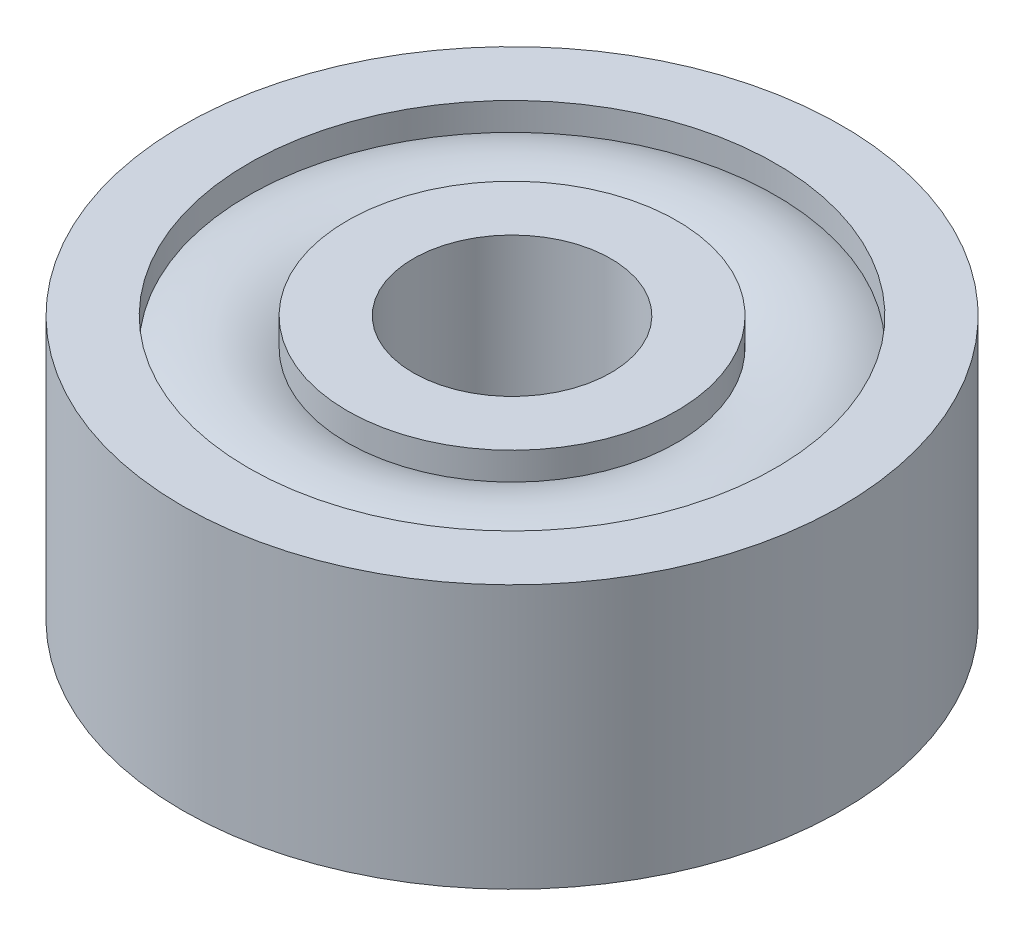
ISO-10303-21;
HEADER;
FILE_DESCRIPTION(('STEP AP214'),'2;1');
FILE_NAME('part.step','',(''),(''),'','','');
FILE_SCHEMA(('AUTOMOTIVE_DESIGN { 1 0 10303 214 1 1 1 1 }'));
ENDSEC;
DATA;
#1=APPLICATION_CONTEXT('core data for automotive mechanical design processes');
#2=APPLICATION_PROTOCOL_DEFINITION('international standard','automotive_design',2000,#1);
#3=PRODUCT_CONTEXT('',#1,'mechanical');
#4=PRODUCT('Part','Part','',(#3));
#5=PRODUCT_RELATED_PRODUCT_CATEGORY('part','',(#4));
#6=PRODUCT_DEFINITION_FORMATION('','',#4);
#7=PRODUCT_DEFINITION_CONTEXT('part definition',#1,'design');
#8=PRODUCT_DEFINITION('design','',#6,#7);
#9=PRODUCT_DEFINITION_SHAPE('','',#8);
#10=(LENGTH_UNIT() NAMED_UNIT(*) SI_UNIT(.MILLI.,.METRE.));
#11=(NAMED_UNIT(*) PLANE_ANGLE_UNIT() SI_UNIT($,.RADIAN.));
#12=(NAMED_UNIT(*) SI_UNIT($,.STERADIAN.) SOLID_ANGLE_UNIT());
#13=UNCERTAINTY_MEASURE_WITH_UNIT(LENGTH_MEASURE(1.E-05),#10,'distance_accuracy_value','');
#14=(GEOMETRIC_REPRESENTATION_CONTEXT(3) GLOBAL_UNCERTAINTY_ASSIGNED_CONTEXT((#13)) GLOBAL_UNIT_ASSIGNED_CONTEXT((#10,
#11,#12)) REPRESENTATION_CONTEXT('',''));
#15=CARTESIAN_POINT('',(0.,0.,0.));
#16=DIRECTION('',(0.,0.,1.));
#17=DIRECTION('',(1.,0.,0.));
#18=AXIS2_PLACEMENT_3D('',#15,#16,#17);
#19=CARTESIAN_POINT('',(4.,-2.,0.));
#20=DIRECTION('',(0.,1.,0.));
#21=DIRECTION('',(0.,0.,1.));
#22=AXIS2_PLACEMENT_3D('',#19,#20,#21);
#23=PLANE('',#22);
#24=CARTESIAN_POINT('',(0.,-2.,0.));
#25=DIRECTION('',(0.,1.,0.));
#26=DIRECTION('',(0.,0.,1.));
#27=AXIS2_PLACEMENT_3D('',#24,#25,#26);
#28=CIRCLE('',#27,5.);
#29=CARTESIAN_POINT('',(0.,-2.,5.));
#30=VERTEX_POINT('',#29);
#31=EDGE_CURVE('E10',#30,#30,#28,.T.);
#32=ORIENTED_EDGE('',*,*,#31,.F.);
#33=EDGE_LOOP('',(#32));
#34=FACE_BOUND('',#33,.T.);
#35=CARTESIAN_POINT('',(0.,-2.,0.));
#36=DIRECTION('',(0.,1.,0.));
#37=DIRECTION('',(0.,0.,1.));
#38=AXIS2_PLACEMENT_3D('',#35,#36,#37);
#39=CIRCLE('',#38,4.);
#40=CARTESIAN_POINT('',(0.,-2.,4.));
#41=VERTEX_POINT('',#40);
#42=EDGE_CURVE('E72',#41,#41,#39,.T.);
#43=ORIENTED_EDGE('',*,*,#42,.T.);
#44=EDGE_LOOP('',(#43));
#45=FACE_BOUND('',#44,.T.);
#46=ADVANCED_FACE('F32',(#34,#45),#23,.F.);
#47=CARTESIAN_POINT('',(0.,2.,0.));
#48=DIRECTION('',(0.,1.,0.));
#49=DIRECTION('',(0.,0.,1.));
#50=AXIS2_PLACEMENT_3D('',#47,#48,#49);
#51=CYLINDRICAL_SURFACE('',#50,5.);
#52=CARTESIAN_POINT('',(0.,2.,0.));
#53=DIRECTION('',(0.,1.,0.));
#54=DIRECTION('',(0.,0.,1.));
#55=AXIS2_PLACEMENT_3D('',#52,#53,#54);
#56=CIRCLE('',#55,5.);
#57=CARTESIAN_POINT('',(0.,2.,5.));
#58=VERTEX_POINT('',#57);
#59=EDGE_CURVE('E38',#58,#58,#56,.T.);
#60=ORIENTED_EDGE('',*,*,#59,.F.);
#61=EDGE_LOOP('',(#60));
#62=FACE_BOUND('',#61,.T.);
#63=ORIENTED_EDGE('',*,*,#31,.T.);
#64=EDGE_LOOP('',(#63));
#65=FACE_BOUND('',#64,.T.);
#66=ADVANCED_FACE('F133',(#62,#65),#51,.T.);
#67=CARTESIAN_POINT('',(4.,2.,0.));
#68=DIRECTION('',(0.,-1.,0.));
#69=DIRECTION('',(0.,0.,-1.));
#70=AXIS2_PLACEMENT_3D('',#67,#68,#69);
#71=PLANE('',#70);
#72=CARTESIAN_POINT('',(0.,2.,0.));
#73=DIRECTION('',(0.,1.,0.));
#74=DIRECTION('',(0.,0.,1.));
#75=AXIS2_PLACEMENT_3D('',#72,#73,#74);
#76=CIRCLE('',#75,4.);
#77=CARTESIAN_POINT('',(0.,2.,4.));
#78=VERTEX_POINT('',#77);
#79=EDGE_CURVE('E42',#78,#78,#76,.T.);
#80=ORIENTED_EDGE('',*,*,#79,.F.);
#81=EDGE_LOOP('',(#80));
#82=FACE_BOUND('',#81,.T.);
#83=ORIENTED_EDGE('',*,*,#59,.T.);
#84=EDGE_LOOP('',(#83));
#85=FACE_BOUND('',#84,.T.);
#86=ADVANCED_FACE('F128',(#82,#85),#71,.F.);
#87=CARTESIAN_POINT('',(0.,2.,0.));
#88=DIRECTION('',(0.,1.,0.));
#89=DIRECTION('',(0.,0.,1.));
#90=AXIS2_PLACEMENT_3D('',#87,#88,#89);
#91=CYLINDRICAL_SURFACE('',#90,4.);
#92=CARTESIAN_POINT('',(0.,1.58113883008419,0.));
#93=DIRECTION('',(0.,1.,0.));
#94=DIRECTION('',(0.,0.,1.));
#95=AXIS2_PLACEMENT_3D('',#92,#93,#94);
#96=CIRCLE('',#95,4.);
#97=CARTESIAN_POINT('',(0.,1.58113883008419,4.));
#98=VERTEX_POINT('',#97);
#99=EDGE_CURVE('E46',#98,#98,#96,.T.);
#100=ORIENTED_EDGE('',*,*,#99,.F.);
#101=EDGE_LOOP('',(#100));
#102=FACE_BOUND('',#101,.T.);
#103=ORIENTED_EDGE('',*,*,#79,.T.);
#104=EDGE_LOOP('',(#103));
#105=FACE_BOUND('',#104,.T.);
#106=ADVANCED_FACE('F122',(#102,#105),#91,.F.);
#107=CARTESIAN_POINT('',(0.,0.,0.));
#108=DIRECTION('',(0.,1.,0.));
#109=DIRECTION('',(0.,0.,1.));
#110=AXIS2_PLACEMENT_3D('',#107,#108,#109);
#111=TOROIDAL_SURFACE('',#110,3.25,1.75);
#112=CARTESIAN_POINT('',(0.,1.58113883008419,0.));
#113=DIRECTION('',(0.,1.,0.));
#114=DIRECTION('',(0.,0.,1.));
#115=AXIS2_PLACEMENT_3D('',#112,#113,#114);
#116=CIRCLE('',#115,2.5);
#117=CARTESIAN_POINT('',(0.,1.58113883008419,2.5));
#118=VERTEX_POINT('',#117);
#119=EDGE_CURVE('E51',#118,#118,#116,.T.);
#120=ORIENTED_EDGE('',*,*,#119,.F.);
#121=EDGE_LOOP('',(#120));
#122=FACE_BOUND('',#121,.T.);
#123=ORIENTED_EDGE('',*,*,#99,.T.);
#124=EDGE_LOOP('',(#123));
#125=FACE_BOUND('',#124,.T.);
#126=ADVANCED_FACE('F116',(#122,#125),#111,.T.);
#127=CARTESIAN_POINT('',(0.,2.,0.));
#128=DIRECTION('',(0.,1.,0.));
#129=DIRECTION('',(0.,0.,1.));
#130=AXIS2_PLACEMENT_3D('',#127,#128,#129);
#131=CYLINDRICAL_SURFACE('',#130,2.5);
#132=CARTESIAN_POINT('',(0.,2.,0.));
#133=DIRECTION('',(0.,1.,0.));
#134=DIRECTION('',(0.,0.,1.));
#135=AXIS2_PLACEMENT_3D('',#132,#133,#134);
#136=CIRCLE('',#135,2.5);
#137=CARTESIAN_POINT('',(0.,2.,2.5));
#138=VERTEX_POINT('',#137);
#139=EDGE_CURVE('E54',#138,#138,#136,.T.);
#140=ORIENTED_EDGE('',*,*,#139,.F.);
#141=EDGE_LOOP('',(#140));
#142=FACE_BOUND('',#141,.T.);
#143=ORIENTED_EDGE('',*,*,#119,.T.);
#144=EDGE_LOOP('',(#143));
#145=FACE_BOUND('',#144,.T.);
#146=ADVANCED_FACE('F110',(#142,#145),#131,.T.);
#147=CARTESIAN_POINT('',(1.5,2.,0.));
#148=DIRECTION('',(0.,-1.,0.));
#149=DIRECTION('',(0.,0.,-1.));
#150=AXIS2_PLACEMENT_3D('',#147,#148,#149);
#151=PLANE('',#150);
#152=CARTESIAN_POINT('',(0.,2.,0.));
#153=DIRECTION('',(0.,1.,0.));
#154=DIRECTION('',(0.,0.,1.));
#155=AXIS2_PLACEMENT_3D('',#152,#153,#154);
#156=CIRCLE('',#155,1.5);
#157=CARTESIAN_POINT('',(0.,2.,1.5));
#158=VERTEX_POINT('',#157);
#159=EDGE_CURVE('E57',#158,#158,#156,.T.);
#160=ORIENTED_EDGE('',*,*,#159,.F.);
#161=EDGE_LOOP('',(#160));
#162=FACE_BOUND('',#161,.T.);
#163=ORIENTED_EDGE('',*,*,#139,.T.);
#164=EDGE_LOOP('',(#163));
#165=FACE_BOUND('',#164,.T.);
#166=ADVANCED_FACE('F104',(#162,#165),#151,.F.);
#167=CARTESIAN_POINT('',(0.,2.,0.));
#168=DIRECTION('',(0.,1.,0.));
#169=DIRECTION('',(0.,0.,1.));
#170=AXIS2_PLACEMENT_3D('',#167,#168,#169);
#171=CYLINDRICAL_SURFACE('',#170,1.5);
#172=CARTESIAN_POINT('',(0.,-2.,0.));
#173=DIRECTION('',(0.,1.,0.));
#174=DIRECTION('',(0.,0.,1.));
#175=AXIS2_PLACEMENT_3D('',#172,#173,#174);
#176=CIRCLE('',#175,1.5);
#177=CARTESIAN_POINT('',(0.,-2.,1.5));
#178=VERTEX_POINT('',#177);
#179=EDGE_CURVE('E60',#178,#178,#176,.T.);
#180=ORIENTED_EDGE('',*,*,#179,.F.);
#181=EDGE_LOOP('',(#180));
#182=FACE_BOUND('',#181,.T.);
#183=ORIENTED_EDGE('',*,*,#159,.T.);
#184=EDGE_LOOP('',(#183));
#185=FACE_BOUND('',#184,.T.);
#186=ADVANCED_FACE('F98',(#182,#185),#171,.F.);
#187=CARTESIAN_POINT('',(1.5,-2.,0.));
#188=DIRECTION('',(0.,1.,0.));
#189=DIRECTION('',(0.,0.,1.));
#190=AXIS2_PLACEMENT_3D('',#187,#188,#189);
#191=PLANE('',#190);
#192=CARTESIAN_POINT('',(0.,-2.,0.));
#193=DIRECTION('',(0.,1.,0.));
#194=DIRECTION('',(0.,0.,1.));
#195=AXIS2_PLACEMENT_3D('',#192,#193,#194);
#196=CIRCLE('',#195,2.5);
#197=CARTESIAN_POINT('',(0.,-2.,2.5));
#198=VERTEX_POINT('',#197);
#199=EDGE_CURVE('E63',#198,#198,#196,.T.);
#200=ORIENTED_EDGE('',*,*,#199,.F.);
#201=EDGE_LOOP('',(#200));
#202=FACE_BOUND('',#201,.T.);
#203=ORIENTED_EDGE('',*,*,#179,.T.);
#204=EDGE_LOOP('',(#203));
#205=FACE_BOUND('',#204,.T.);
#206=ADVANCED_FACE('F92',(#202,#205),#191,.F.);
#207=CARTESIAN_POINT('',(0.,2.,0.));
#208=DIRECTION('',(0.,1.,0.));
#209=DIRECTION('',(0.,0.,1.));
#210=AXIS2_PLACEMENT_3D('',#207,#208,#209);
#211=CYLINDRICAL_SURFACE('',#210,2.5);
#212=CARTESIAN_POINT('',(0.,-1.58113883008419,0.));
#213=DIRECTION('',(0.,1.,0.));
#214=DIRECTION('',(0.,0.,1.));
#215=AXIS2_PLACEMENT_3D('',#212,#213,#214);
#216=CIRCLE('',#215,2.5);
#217=CARTESIAN_POINT('',(0.,-1.58113883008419,2.5));
#218=VERTEX_POINT('',#217);
#219=EDGE_CURVE('E66',#218,#218,#216,.T.);
#220=ORIENTED_EDGE('',*,*,#219,.F.);
#221=EDGE_LOOP('',(#220));
#222=FACE_BOUND('',#221,.T.);
#223=ORIENTED_EDGE('',*,*,#199,.T.);
#224=EDGE_LOOP('',(#223));
#225=FACE_BOUND('',#224,.T.);
#226=ADVANCED_FACE('F86',(#222,#225),#211,.T.);
#227=CARTESIAN_POINT('',(0.,0.,0.));
#228=DIRECTION('',(0.,1.,0.));
#229=DIRECTION('',(0.,0.,1.));
#230=AXIS2_PLACEMENT_3D('',#227,#228,#229);
#231=TOROIDAL_SURFACE('',#230,3.25,1.75);
#232=CARTESIAN_POINT('',(0.,-1.58113883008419,0.));
#233=DIRECTION('',(0.,1.,0.));
#234=DIRECTION('',(0.,0.,1.));
#235=AXIS2_PLACEMENT_3D('',#232,#233,#234);
#236=CIRCLE('',#235,4.);
#237=CARTESIAN_POINT('',(0.,-1.58113883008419,4.));
#238=VERTEX_POINT('',#237);
#239=EDGE_CURVE('E69',#238,#238,#236,.T.);
#240=ORIENTED_EDGE('',*,*,#239,.F.);
#241=EDGE_LOOP('',(#240));
#242=FACE_BOUND('',#241,.T.);
#243=ORIENTED_EDGE('',*,*,#219,.T.);
#244=EDGE_LOOP('',(#243));
#245=FACE_BOUND('',#244,.T.);
#246=ADVANCED_FACE('F80',(#242,#245),#231,.T.);
#247=CARTESIAN_POINT('',(0.,2.,0.));
#248=DIRECTION('',(0.,1.,0.));
#249=DIRECTION('',(0.,0.,1.));
#250=AXIS2_PLACEMENT_3D('',#247,#248,#249);
#251=CYLINDRICAL_SURFACE('',#250,4.);
#252=ORIENTED_EDGE('',*,*,#42,.F.);
#253=EDGE_LOOP('',(#252));
#254=FACE_BOUND('',#253,.T.);
#255=ORIENTED_EDGE('',*,*,#239,.T.);
#256=EDGE_LOOP('',(#255));
#257=FACE_BOUND('',#256,.T.);
#258=ADVANCED_FACE('F77',(#254,#257),#251,.F.);
#259=CLOSED_SHELL('',(#46,#66,#86,#106,#126,#146,#166,#186,#206,#226,#246,#258));
#260=MANIFOLD_SOLID_BREP('B2',#259);
#261=ADVANCED_BREP_SHAPE_REPRESENTATION('',(#18,#260),#14);
#262=SHAPE_DEFINITION_REPRESENTATION(#9,#261);
ENDSEC;
END-ISO-10303-21;
